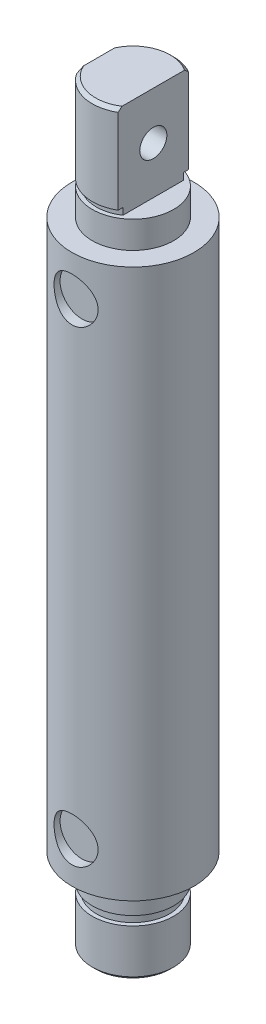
ISO-10303-21;
HEADER;
FILE_DESCRIPTION(('STEP AP214'),'2;1');
FILE_NAME('part.step','',(''),(''),'','','');
FILE_SCHEMA(('AUTOMOTIVE_DESIGN { 1 0 10303 214 1 1 1 1 }'));
ENDSEC;
DATA;
#1=APPLICATION_CONTEXT('core data for automotive mechanical design processes');
#2=APPLICATION_PROTOCOL_DEFINITION('international standard','automotive_design',2000,#1);
#3=PRODUCT_CONTEXT('',#1,'mechanical');
#4=PRODUCT('Part','Part','',(#3));
#5=PRODUCT_RELATED_PRODUCT_CATEGORY('part','',(#4));
#6=PRODUCT_DEFINITION_FORMATION('','',#4);
#7=PRODUCT_DEFINITION_CONTEXT('part definition',#1,'design');
#8=PRODUCT_DEFINITION('design','',#6,#7);
#9=PRODUCT_DEFINITION_SHAPE('','',#8);
#10=(LENGTH_UNIT() NAMED_UNIT(*) SI_UNIT(.MILLI.,.METRE.));
#11=(NAMED_UNIT(*) PLANE_ANGLE_UNIT() SI_UNIT($,.RADIAN.));
#12=(NAMED_UNIT(*) SI_UNIT($,.STERADIAN.) SOLID_ANGLE_UNIT());
#13=UNCERTAINTY_MEASURE_WITH_UNIT(LENGTH_MEASURE(1.E-05),#10,'distance_accuracy_value','');
#14=(GEOMETRIC_REPRESENTATION_CONTEXT(3) GLOBAL_UNCERTAINTY_ASSIGNED_CONTEXT((#13)) GLOBAL_UNIT_ASSIGNED_CONTEXT((#10,
#11,#12)) REPRESENTATION_CONTEXT('',''));
#15=CARTESIAN_POINT('',(0.,0.,0.));
#16=DIRECTION('',(0.,0.,1.));
#17=DIRECTION('',(1.,0.,0.));
#18=AXIS2_PLACEMENT_3D('',#15,#16,#17);
#19=CARTESIAN_POINT('',(0.,-6.35,0.));
#20=DIRECTION('',(0.,-1.,0.));
#21=DIRECTION('',(0.,0.,-1.));
#22=AXIS2_PLACEMENT_3D('',#19,#20,#21);
#23=PLANE('',#22);
#24=CARTESIAN_POINT('',(0.,-6.35,0.));
#25=DIRECTION('',(0.,-1.,0.));
#26=DIRECTION('',(0.,0.,-1.));
#27=AXIS2_PLACEMENT_3D('',#24,#25,#26);
#28=CIRCLE('',#27,9.525);
#29=CARTESIAN_POINT('',(0.,-6.35,9.525));
#30=VERTEX_POINT('',#29);
#31=EDGE_CURVE('E164',#30,#30,#28,.T.);
#32=ORIENTED_EDGE('',*,*,#31,.T.);
#33=EDGE_LOOP('',(#32));
#34=FACE_BOUND('',#33,.T.);
#35=CARTESIAN_POINT('',(0.,-6.35,0.));
#36=DIRECTION('',(0.,-1.,0.));
#37=DIRECTION('',(0.,0.,-1.));
#38=AXIS2_PLACEMENT_3D('',#35,#36,#37);
#39=CIRCLE('',#38,8.5598);
#40=CARTESIAN_POINT('',(0.,-6.35,-8.5598));
#41=VERTEX_POINT('',#40);
#42=EDGE_CURVE('E500',#41,#41,#39,.T.);
#43=ORIENTED_EDGE('',*,*,#42,.F.);
#44=EDGE_LOOP('',(#43));
#45=FACE_BOUND('',#44,.T.);
#46=ADVANCED_FACE('F35',(#34,#45),#23,.T.);
#47=CARTESIAN_POINT('',(0.,134.9375,0.));
#48=DIRECTION('',(0.,-1.,0.));
#49=DIRECTION('',(0.,0.,-1.));
#50=AXIS2_PLACEMENT_3D('',#47,#48,#49);
#51=CYLINDRICAL_SURFACE('',#50,9.525);
#52=DIRECTION('',(0.,-1.,0.));
#53=VECTOR('',#52,1.);
#54=CARTESIAN_POINT('',(4.7625,157.1625,8.24889197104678));
#55=LINE('',#54,#53);
#56=CARTESIAN_POINT('',(4.7625,156.3751,8.24889197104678));
#57=VERTEX_POINT('',#56);
#58=CARTESIAN_POINT('',(4.7625,136.525,8.24889197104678));
#59=VERTEX_POINT('',#58);
#60=EDGE_CURVE('E189',#57,#59,#55,.T.);
#61=ORIENTED_EDGE('',*,*,#60,.F.);
#62=CARTESIAN_POINT('',(0.,156.3751,0.));
#63=DIRECTION('',(0.,1.,0.));
#64=DIRECTION('',(0.,0.,1.));
#65=AXIS2_PLACEMENT_3D('',#62,#63,#64);
#66=CIRCLE('',#65,9.525);
#67=CARTESIAN_POINT('',(-7.9375,156.3751,5.2651418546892));
#68=VERTEX_POINT('',#67);
#69=EDGE_CURVE('E292',#57,#68,#66,.F.);
#70=ORIENTED_EDGE('',*,*,#69,.T.);
#71=DIRECTION('',(0.,-1.,0.));
#72=VECTOR('',#71,1.);
#73=CARTESIAN_POINT('',(-7.9375,157.1625,5.2651418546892));
#74=LINE('',#73,#72);
#75=CARTESIAN_POINT('',(-7.9375,136.525,5.26514185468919));
#76=VERTEX_POINT('',#75);
#77=EDGE_CURVE('E186',#68,#76,#74,.T.);
#78=ORIENTED_EDGE('',*,*,#77,.T.);
#79=CARTESIAN_POINT('',(0.,136.525,0.));
#80=DIRECTION('',(0.,-1.,0.));
#81=DIRECTION('',(0.,0.,-1.));
#82=AXIS2_PLACEMENT_3D('',#79,#80,#81);
#83=CIRCLE('',#82,9.525);
#84=EDGE_CURVE('E364',#59,#76,#83,.T.);
#85=ORIENTED_EDGE('',*,*,#84,.F.);
#86=EDGE_LOOP('',(#61,#70,#78,#85));
#87=FACE_BOUND('',#86,.T.);
#88=ADVANCED_FACE('F221',(#87),#51,.T.);
#89=DIRECTION('',(0.,-1.,0.));
#90=VECTOR('',#89,1.);
#91=CARTESIAN_POINT('',(-7.9375,157.1625,-5.2651418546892));
#92=LINE('',#91,#90);
#93=CARTESIAN_POINT('',(-7.9375,156.3751,-5.2651418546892));
#94=VERTEX_POINT('',#93);
#95=CARTESIAN_POINT('',(-7.9375,136.525,-5.26514185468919));
#96=VERTEX_POINT('',#95);
#97=EDGE_CURVE('E168',#94,#96,#92,.T.);
#98=ORIENTED_EDGE('',*,*,#97,.F.);
#99=CARTESIAN_POINT('',(0.,156.3751,0.));
#100=DIRECTION('',(0.,1.,0.));
#101=DIRECTION('',(0.,0.,1.));
#102=AXIS2_PLACEMENT_3D('',#99,#100,#101);
#103=CIRCLE('',#102,9.525);
#104=CARTESIAN_POINT('',(4.7625,156.3751,-8.24889197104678));
#105=VERTEX_POINT('',#104);
#106=EDGE_CURVE('E62',#94,#105,#103,.F.);
#107=ORIENTED_EDGE('',*,*,#106,.T.);
#108=DIRECTION('',(0.,-1.,0.));
#109=VECTOR('',#108,1.);
#110=CARTESIAN_POINT('',(4.7625,157.1625,-8.24889197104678));
#111=LINE('',#110,#109);
#112=CARTESIAN_POINT('',(4.7625,136.525,-8.24889197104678));
#113=VERTEX_POINT('',#112);
#114=EDGE_CURVE('E163',#105,#113,#111,.T.);
#115=ORIENTED_EDGE('',*,*,#114,.T.);
#116=EDGE_CURVE('E359',#96,#113,#83,.T.);
#117=ORIENTED_EDGE('',*,*,#116,.F.);
#118=EDGE_LOOP('',(#98,#107,#115,#117));
#119=FACE_BOUND('',#118,.T.);
#120=ADVANCED_FACE('F232',(#119),#51,.T.);
#121=CARTESIAN_POINT('',(0.,0.,0.));
#122=DIRECTION('',(0.,1.,0.));
#123=DIRECTION('',(0.,0.,1.));
#124=AXIS2_PLACEMENT_3D('',#121,#122,#123);
#125=PLANE('',#124);
#126=CARTESIAN_POINT('',(0.,0.,0.));
#127=DIRECTION('',(0.,1.,0.));
#128=DIRECTION('',(0.,0.,1.));
#129=AXIS2_PLACEMENT_3D('',#126,#127,#128);
#130=CIRCLE('',#129,14.2875);
#131=CARTESIAN_POINT('',(0.,0.,14.2875));
#132=VERTEX_POINT('',#131);
#133=EDGE_CURVE('E172',#132,#132,#130,.T.);
#134=ORIENTED_EDGE('',*,*,#133,.F.);
#135=EDGE_LOOP('',(#134));
#136=FACE_BOUND('',#135,.T.);
#137=CARTESIAN_POINT('',(0.,0.,0.));
#138=DIRECTION('',(0.,1.,0.));
#139=DIRECTION('',(0.,0.,1.));
#140=AXIS2_PLACEMENT_3D('',#137,#138,#139);
#141=CIRCLE('',#140,9.525);
#142=CARTESIAN_POINT('',(0.,0.,9.525));
#143=VERTEX_POINT('',#142);
#144=EDGE_CURVE('E138',#143,#143,#141,.F.);
#145=ORIENTED_EDGE('',*,*,#144,.F.);
#146=EDGE_LOOP('',(#145));
#147=FACE_BOUND('',#146,.T.);
#148=ADVANCED_FACE('F233',(#136,#147),#125,.F.);
#149=CARTESIAN_POINT('',(0.,128.5875,0.));
#150=DIRECTION('',(0.,1.,0.));
#151=DIRECTION('',(0.,0.,1.));
#152=AXIS2_PLACEMENT_3D('',#149,#150,#151);
#153=PLANE('',#152);
#154=CARTESIAN_POINT('',(0.,128.5875,0.));
#155=DIRECTION('',(0.,1.,0.));
#156=DIRECTION('',(0.,0.,1.));
#157=AXIS2_PLACEMENT_3D('',#154,#155,#156);
#158=CIRCLE('',#157,14.2875);
#159=CARTESIAN_POINT('',(0.,128.5875,14.2875));
#160=VERTEX_POINT('',#159);
#161=EDGE_CURVE('E175',#160,#160,#158,.T.);
#162=ORIENTED_EDGE('',*,*,#161,.T.);
#163=EDGE_LOOP('',(#162));
#164=FACE_BOUND('',#163,.T.);
#165=CARTESIAN_POINT('',(0.,128.5875,0.));
#166=DIRECTION('',(0.,1.,0.));
#167=DIRECTION('',(0.,0.,1.));
#168=AXIS2_PLACEMENT_3D('',#165,#166,#167);
#169=CIRCLE('',#168,9.525);
#170=CARTESIAN_POINT('',(0.,128.5875,-9.525));
#171=VERTEX_POINT('',#170);
#172=EDGE_CURVE('E167',#171,#171,#169,.T.);
#173=ORIENTED_EDGE('',*,*,#172,.F.);
#174=EDGE_LOOP('',(#173));
#175=FACE_BOUND('',#174,.T.);
#176=ADVANCED_FACE('F235',(#164,#175),#153,.T.);
#177=CARTESIAN_POINT('',(0.,128.5875,0.));
#178=DIRECTION('',(0.,-1.,0.));
#179=DIRECTION('',(0.,0.,-1.));
#180=AXIS2_PLACEMENT_3D('',#177,#178,#179);
#181=CYLINDRICAL_SURFACE('',#180,14.2875);
#182=CARTESIAN_POINT('',(5.15874000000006,119.0625,13.3236653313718));
#183=CARTESIAN_POINT('',(5.1587404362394,118.922816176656,13.3236649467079));
#184=CARTESIAN_POINT('',(5.15306200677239,118.783138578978,13.325867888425));
#185=CARTESIAN_POINT('',(5.13040559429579,118.504790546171,13.3346069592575));
#186=CARTESIAN_POINT('',(5.11342378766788,118.366120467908,13.3411445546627));
#187=CARTESIAN_POINT('',(5.06833902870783,118.090916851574,13.3583372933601));
#188=CARTESIAN_POINT('',(5.04024024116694,117.954382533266,13.3689908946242));
#189=CARTESIAN_POINT('',(4.97318449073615,117.684311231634,13.3940797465));
#190=CARTESIAN_POINT('',(4.93422324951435,117.550775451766,13.4085164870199));
#191=CARTESIAN_POINT('',(4.84591339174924,117.28799251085,13.4406837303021));
#192=CARTESIAN_POINT('',(4.79659286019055,117.158734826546,13.4584053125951));
#193=CARTESIAN_POINT('',(4.68791492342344,116.904922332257,13.4966449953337));
#194=CARTESIAN_POINT('',(4.62855378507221,116.780369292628,13.5171641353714));
#195=CARTESIAN_POINT('',(4.43606227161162,116.414931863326,13.582060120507));
#196=CARTESIAN_POINT('',(4.28845629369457,116.182069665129,13.6298013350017));
#197=CARTESIAN_POINT('',(3.95183781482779,115.734219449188,13.7312700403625));
#198=CARTESIAN_POINT('',(3.76135188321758,115.52038613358,13.7851643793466));
#199=CARTESIAN_POINT('',(3.34727158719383,115.126788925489,13.8915062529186));
#200=CARTESIAN_POINT('',(3.12367081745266,114.947031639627,13.9439535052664));
#201=CARTESIAN_POINT('',(2.76398265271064,114.704186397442,14.018158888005));
#202=CARTESIAN_POINT('',(2.63789299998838,114.626728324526,14.0424884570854));
#203=CARTESIAN_POINT('',(2.37918623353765,114.482767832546,14.08862494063));
#204=CARTESIAN_POINT('',(2.24657175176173,114.416261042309,14.1104328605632));
#205=CARTESIAN_POINT('',(1.97568405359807,114.294762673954,14.1509043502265));
#206=CARTESIAN_POINT('',(1.83740986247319,114.239773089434,14.1695673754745));
#207=CARTESIAN_POINT('',(1.55628028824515,114.14185682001,14.20319231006));
#208=CARTESIAN_POINT('',(1.41342706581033,114.098924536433,14.2181559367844));
#209=CARTESIAN_POINT('',(1.12995721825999,114.026994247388,14.2434296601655));
#210=CARTESIAN_POINT('',(0.989478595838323,113.997508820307,14.2539015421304));
#211=CARTESIAN_POINT('',(0.706367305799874,113.950335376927,14.2707322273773));
#212=CARTESIAN_POINT('',(0.563735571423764,113.932642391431,14.2770927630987));
#213=CARTESIAN_POINT('',(0.277375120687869,113.909219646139,14.2855254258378));
#214=CARTESIAN_POINT('',(0.133646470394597,113.903489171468,14.2875978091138));
#215=CARTESIAN_POINT('',(-0.153782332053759,113.904050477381,14.2873950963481));
#216=CARTESIAN_POINT('',(-0.297482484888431,113.910341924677,14.2851201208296));
#217=CARTESIAN_POINT('',(-0.577109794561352,113.934311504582,14.2764932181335));
#218=CARTESIAN_POINT('',(-0.713089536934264,113.951450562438,14.2703343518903));
#219=CARTESIAN_POINT('',(-0.983085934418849,113.99644855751,14.2542798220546));
#220=CARTESIAN_POINT('',(-1.11710191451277,114.02431109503,14.2443829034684));
#221=CARTESIAN_POINT('',(-1.38216767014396,114.090491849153,14.2211098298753));
#222=CARTESIAN_POINT('',(-1.5132184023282,114.128806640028,14.2077348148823));
#223=CARTESIAN_POINT('',(-1.77159674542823,114.215580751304,14.1778357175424));
#224=CARTESIAN_POINT('',(-1.89892292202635,114.264043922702,14.1613104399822));
#225=CARTESIAN_POINT('',(-2.15074720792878,114.371458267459,14.1252729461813));
#226=CARTESIAN_POINT('',(-2.27518237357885,114.430544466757,14.1057227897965));
#227=CARTESIAN_POINT('',(-2.51865071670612,114.558287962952,14.0642929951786));
#228=CARTESIAN_POINT('',(-2.63768191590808,114.626948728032,14.0424125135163));
#229=CARTESIAN_POINT('',(-2.98559887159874,114.846590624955,13.9740670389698));
#230=CARTESIAN_POINT('',(-3.20548456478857,115.011307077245,13.924871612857));
#231=CARTESIAN_POINT('',(-3.62719998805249,115.382906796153,13.8212127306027));
#232=CARTESIAN_POINT('',(-3.8273878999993,115.591601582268,13.7666083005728));
#233=CARTESIAN_POINT('',(-4.19060911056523,116.040162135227,13.6604285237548));
#234=CARTESIAN_POINT('',(-4.35363442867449,116.280034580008,13.6088538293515));
#235=CARTESIAN_POINT('',(-4.5680614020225,116.660980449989,13.5377728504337));
#236=CARTESIAN_POINT('',(-4.63502720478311,116.792902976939,13.5149319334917));
#237=CARTESIAN_POINT('',(-4.75752951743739,117.062404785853,13.4722965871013));
#238=CARTESIAN_POINT('',(-4.81307090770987,117.199981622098,13.4525008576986));
#239=CARTESIAN_POINT('',(-4.91221250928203,117.479839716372,13.4166168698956));
#240=CARTESIAN_POINT('',(-4.95581254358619,117.622121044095,13.400528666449));
#241=CARTESIAN_POINT('',(-5.03061288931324,117.91025468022,13.3726282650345));
#242=CARTESIAN_POINT('',(-5.06181913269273,118.056105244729,13.3608140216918));
#243=CARTESIAN_POINT('',(-5.11023362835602,118.342686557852,13.3423687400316));
#244=CARTESIAN_POINT('',(-5.12807938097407,118.483294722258,13.3355023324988));
#245=CARTESIAN_POINT('',(-5.15213568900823,118.765593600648,13.3262268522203));
#246=CARTESIAN_POINT('',(-5.15835115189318,118.907283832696,13.3238158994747));
#247=CARTESIAN_POINT('',(-5.15909347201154,119.190697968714,13.3235284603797));
#248=CARTESIAN_POINT('',(-5.15362037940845,119.332421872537,13.32565195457));
#249=CARTESIAN_POINT('',(-5.1310451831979,119.614799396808,13.3343607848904));
#250=CARTESIAN_POINT('',(-5.11394328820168,119.75545303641,13.3409460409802));
#251=CARTESIAN_POINT('',(-5.06927476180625,120.028613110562,13.3579808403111));
#252=CARTESIAN_POINT('',(-5.04218964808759,120.161209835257,13.3682520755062));
#253=CARTESIAN_POINT('',(-4.9777761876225,120.42360280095,13.3923702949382));
#254=CARTESIAN_POINT('',(-4.94044436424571,120.553398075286,13.4062184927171));
#255=CARTESIAN_POINT('',(-4.85586580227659,120.809301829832,13.4370848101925));
#256=CARTESIAN_POINT('',(-4.80862112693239,120.935411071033,13.4541022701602));
#257=CARTESIAN_POINT('',(-4.70458767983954,121.183240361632,13.4908320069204));
#258=CARTESIAN_POINT('',(-4.64779544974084,121.304958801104,13.5105452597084));
#259=CARTESIAN_POINT('',(-4.45936465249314,121.670865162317,13.5744157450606));
#260=CARTESIAN_POINT('',(-4.31262548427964,121.906847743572,13.6221721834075));
#261=CARTESIAN_POINT('',(-3.98374232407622,122.351721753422,13.7219479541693));
#262=CARTESIAN_POINT('',(-3.80158621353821,122.560603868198,13.7739687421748));
#263=CARTESIAN_POINT('',(-3.49938993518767,122.855689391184,13.8527489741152));
#264=CARTESIAN_POINT('',(-3.39044242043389,122.953376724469,13.8798792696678));
#265=CARTESIAN_POINT('',(-3.16451034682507,123.139244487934,13.9331252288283));
#266=CARTESIAN_POINT('',(-3.04752861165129,123.227428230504,13.9592412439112));
#267=CARTESIAN_POINT('',(-2.80618662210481,123.393712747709,14.0097530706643));
#268=CARTESIAN_POINT('',(-2.68182331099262,123.471809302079,14.0341481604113));
#269=CARTESIAN_POINT('',(-2.42659742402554,123.617254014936,14.0805217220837));
#270=CARTESIAN_POINT('',(-2.29573764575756,123.684606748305,14.1025012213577));
#271=CARTESIAN_POINT('',(-2.02892380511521,123.807767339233,14.1433467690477));
#272=CARTESIAN_POINT('',(-1.89299428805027,123.863623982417,14.1622259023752));
#273=CARTESIAN_POINT('',(-1.61652029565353,123.963628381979,14.1964400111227));
#274=CARTESIAN_POINT('',(-1.47597775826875,124.007780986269,14.2117764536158));
#275=CARTESIAN_POINT('',(-1.19129383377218,124.083966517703,14.2384658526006));
#276=CARTESIAN_POINT('',(-1.04715298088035,124.116001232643,14.2498193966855));
#277=CARTESIAN_POINT('',(-0.756389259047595,124.167622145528,14.2682075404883));
#278=CARTESIAN_POINT('',(-0.609766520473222,124.187208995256,14.2752423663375));
#279=CARTESIAN_POINT('',(-0.323292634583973,124.212997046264,14.2845211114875));
#280=CARTESIAN_POINT('',(-0.183509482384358,124.21987146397,14.2870059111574));
#281=CARTESIAN_POINT('',(0.0962156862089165,124.22223924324,14.2878607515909));
#282=CARTESIAN_POINT('',(0.236157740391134,124.217728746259,14.2862293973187));
#283=CARTESIAN_POINT('',(0.515037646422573,124.197368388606,14.2788949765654));
#284=CARTESIAN_POINT('',(0.653975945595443,124.181523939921,14.2731938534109));
#285=CARTESIAN_POINT('',(0.929948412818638,124.138650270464,14.2578735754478));
#286=CARTESIAN_POINT('',(1.06698185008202,124.111616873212,14.2482529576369));
#287=CARTESIAN_POINT('',(1.33517070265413,124.047328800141,14.2255999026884));
#288=CARTESIAN_POINT('',(1.46638914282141,124.010308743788,14.2126460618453));
#289=CARTESIAN_POINT('',(1.72521181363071,123.926117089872,14.1835562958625));
#290=CARTESIAN_POINT('',(1.85281474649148,123.878941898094,14.1674192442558));
#291=CARTESIAN_POINT('',(2.10355156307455,123.774833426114,14.1323650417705));
#292=CARTESIAN_POINT('',(2.2266864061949,123.717902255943,14.1134484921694));
#293=CARTESIAN_POINT('',(2.46781449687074,123.594701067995,14.0732910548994));
#294=CARTESIAN_POINT('',(2.58580587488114,123.528427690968,14.0520493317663));
#295=CARTESIAN_POINT('',(2.94027955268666,123.310580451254,13.9837997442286));
#296=CARTESIAN_POINT('',(3.1672436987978,123.144125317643,13.9337206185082));
#297=CARTESIAN_POINT('',(3.59082807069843,122.77695443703,13.8306286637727));
#298=CARTESIAN_POINT('',(3.78743777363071,122.576226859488,13.7776148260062));
#299=CARTESIAN_POINT('',(4.06043916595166,122.247943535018,13.6987252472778));
#300=CARTESIAN_POINT('',(4.14954564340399,122.130970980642,13.6719301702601));
#301=CARTESIAN_POINT('',(4.31757490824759,121.889642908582,13.6197992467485));
#302=CARTESIAN_POINT('',(4.39650142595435,121.76529011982,13.5944628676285));
#303=CARTESIAN_POINT('',(4.54362264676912,121.509911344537,13.5460015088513));
#304=CARTESIAN_POINT('',(4.61181277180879,121.378882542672,13.5228774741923));
#305=CARTESIAN_POINT('',(4.73683717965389,121.111107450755,13.4795922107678));
#306=CARTESIAN_POINT('',(4.79367641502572,120.974363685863,13.4594296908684));
#307=CARTESIAN_POINT('',(4.89618512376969,120.694219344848,13.4224826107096));
#308=CARTESIAN_POINT('',(4.94169727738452,120.550754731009,13.4057461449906));
#309=CARTESIAN_POINT('',(5.02007364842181,120.260043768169,13.3765940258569));
#310=CARTESIAN_POINT('',(5.05294337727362,120.112799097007,13.3641764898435));
#311=CARTESIAN_POINT('',(5.10568586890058,119.81571009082,13.3441157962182));
#312=CARTESIAN_POINT('',(5.12556157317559,119.665866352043,13.3364715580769));
#313=CARTESIAN_POINT('',(5.15208790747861,119.364845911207,13.3262467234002));
#314=CARTESIAN_POINT('',(5.15873952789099,119.213669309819,13.3236657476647));
#315=CARTESIAN_POINT('',(5.15874000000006,119.0625,13.3236653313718));
#316=B_SPLINE_CURVE_WITH_KNOTS('',3,(#182,#183,#184,#185,#186,#187,#188,#189,#190,#191,#192,
#193,#194,#195,#196,#197,#198,#199,#200,#201,#202,#203,#204,#205,#206,#207,#208,#209,#210,#211,
#212,#213,#214,#215,#216,#217,#218,#219,#220,#221,#222,#223,#224,#225,#226,#227,#228,#229,#230,
#231,#232,#233,#234,#235,#236,#237,#238,#239,#240,#241,#242,#243,#244,#245,#246,#247,#248,#249,
#250,#251,#252,#253,#254,#255,#256,#257,#258,#259,#260,#261,#262,#263,#264,#265,#266,#267,#268,
#269,#270,#271,#272,#273,#274,#275,#276,#277,#278,#279,#280,#281,#282,#283,#284,#285,#286,#287,
#288,#289,#290,#291,#292,#293,#294,#295,#296,#297,#298,#299,#300,#301,#302,#303,#304,#305,#306,
#307,#308,#309,#310,#311,#312,#313,#314,#315),.UNSPECIFIED.,.T.,.F.,(4,2,2,2,2,2,2,2,2,2,2,2,2,
2,2,2,2,2,2,2,2,2,2,2,2,2,2,2,2,2,2,2,2,2,2,2,2,2,2,2,2,2,2,2,2,2,2,2,2,2,2,2,2,2,2,2,2,2,2,2,2,
2,2,2,2,2,4),(0.,0.41890873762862,0.837959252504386,1.25685292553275,1.67591181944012,
2.0938489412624,2.51194179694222,3.34749842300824,4.21799687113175,5.08866391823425,
5.53810109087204,5.98735843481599,6.43669347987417,6.88581953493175,7.31703432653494,
7.7480672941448,8.17907450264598,8.61006976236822,9.02116812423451,9.43240462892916,
9.84350651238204,10.2547646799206,10.6716766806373,11.0887400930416,11.9222917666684,
12.8013642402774,13.6806253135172,14.1292482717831,14.5776791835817,15.0261167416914,
15.4743394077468,15.8995047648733,16.3244906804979,16.7494747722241,17.1744512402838,
17.5811568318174,17.9880005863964,18.3947597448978,18.8016665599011,19.6436457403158,
20.4859135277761,20.9319385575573,21.3778076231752,21.8238626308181,22.2697271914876,
22.7136587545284,23.1574061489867,23.6010880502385,24.0447467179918,24.4641519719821,
24.8836993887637,25.3030466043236,25.7225504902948,26.1329479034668,26.5434908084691,
26.9539450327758,27.3645472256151,28.2181875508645,29.0721231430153,29.5200715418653,
29.9678553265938,30.4158295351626,30.8636078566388,31.3172959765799,31.7707860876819,
32.2241735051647,32.6775269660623),.UNSPECIFIED.);
#317=CARTESIAN_POINT('',(5.15874000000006,119.0625,13.3236653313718));
#318=VERTEX_POINT('',#317);
#319=EDGE_CURVE('E11',#318,#318,#316,.T.);
#320=ORIENTED_EDGE('',*,*,#319,.T.);
#321=EDGE_LOOP('',(#320));
#322=FACE_BOUND('',#321,.T.);
#323=CARTESIAN_POINT('',(5.15874,9.525,13.3236653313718));
#324=CARTESIAN_POINT('',(5.15874043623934,9.38531617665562,13.3236649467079));
#325=CARTESIAN_POINT('',(5.15306200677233,9.24563857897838,13.325867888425));
#326=CARTESIAN_POINT('',(5.13040559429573,8.96729054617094,13.3346069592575));
#327=CARTESIAN_POINT('',(5.11342378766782,8.82862046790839,13.3411445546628));
#328=CARTESIAN_POINT('',(5.06833902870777,8.55341685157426,13.3583372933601));
#329=CARTESIAN_POINT('',(5.04024024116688,8.41688253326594,13.3689908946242));
#330=CARTESIAN_POINT('',(4.9731844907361,8.14681123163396,13.3940797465));
#331=CARTESIAN_POINT('',(4.93422324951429,8.01327545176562,13.4085164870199));
#332=CARTESIAN_POINT('',(4.84591339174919,7.75049251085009,13.4406837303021));
#333=CARTESIAN_POINT('',(4.7965928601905,7.62123482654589,13.4584053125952));
#334=CARTESIAN_POINT('',(4.68791492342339,7.36742233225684,13.4966449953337));
#335=CARTESIAN_POINT('',(4.62855378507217,7.24286929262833,13.5171641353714));
#336=CARTESIAN_POINT('',(4.43606227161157,6.87743186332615,13.582060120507));
#337=CARTESIAN_POINT('',(4.28845629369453,6.64456966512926,13.6298013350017));
#338=CARTESIAN_POINT('',(3.95183781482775,6.19671944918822,13.7312700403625));
#339=CARTESIAN_POINT('',(3.76135188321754,5.98288613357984,13.7851643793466));
#340=CARTESIAN_POINT('',(3.34727158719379,5.58928892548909,13.8915062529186));
#341=CARTESIAN_POINT('',(3.12367081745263,5.40953163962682,13.9439535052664));
#342=CARTESIAN_POINT('',(2.7639826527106,5.16668639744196,14.018158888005));
#343=CARTESIAN_POINT('',(2.63789299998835,5.08922832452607,14.0424884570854));
#344=CARTESIAN_POINT('',(2.37918623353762,4.9452678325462,14.08862494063));
#345=CARTESIAN_POINT('',(2.24657175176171,4.87876104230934,14.1104328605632));
#346=CARTESIAN_POINT('',(1.97568405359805,4.75726267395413,14.1509043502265));
#347=CARTESIAN_POINT('',(1.83740986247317,4.70227308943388,14.1695673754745));
#348=CARTESIAN_POINT('',(1.55628028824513,4.60435682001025,14.20319231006));
#349=CARTESIAN_POINT('',(1.41342706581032,4.56142453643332,14.2181559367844));
#350=CARTESIAN_POINT('',(1.12995721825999,4.48949424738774,14.2434296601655));
#351=CARTESIAN_POINT('',(0.989478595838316,4.46000882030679,14.2539015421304));
#352=CARTESIAN_POINT('',(0.70636730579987,4.41283537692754,14.2707322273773));
#353=CARTESIAN_POINT('',(0.563735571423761,4.395142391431,14.2770927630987));
#354=CARTESIAN_POINT('',(0.277375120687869,4.37171964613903,14.2855254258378));
#355=CARTESIAN_POINT('',(0.133646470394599,4.36598917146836,14.2875978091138));
#356=CARTESIAN_POINT('',(-0.153782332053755,4.36655047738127,14.2873950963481));
#357=CARTESIAN_POINT('',(-0.297482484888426,4.37284192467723,14.2851201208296));
#358=CARTESIAN_POINT('',(-0.577109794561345,4.39681150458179,14.2764932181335));
#359=CARTESIAN_POINT('',(-0.713089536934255,4.41395056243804,14.2703343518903));
#360=CARTESIAN_POINT('',(-0.983085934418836,4.45894855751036,14.2542798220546));
#361=CARTESIAN_POINT('',(-1.11710191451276,4.48681109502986,14.2443829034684));
#362=CARTESIAN_POINT('',(-1.38216767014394,4.5529918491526,14.2211098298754));
#363=CARTESIAN_POINT('',(-1.51321840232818,4.59130664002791,14.2077348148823));
#364=CARTESIAN_POINT('',(-1.77159674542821,4.67808075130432,14.1778357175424));
#365=CARTESIAN_POINT('',(-1.89892292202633,4.72654392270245,14.1613104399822));
#366=CARTESIAN_POINT('',(-2.15074720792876,4.83395826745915,14.1252729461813));
#367=CARTESIAN_POINT('',(-2.27518237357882,4.89304446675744,14.1057227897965));
#368=CARTESIAN_POINT('',(-2.51865071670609,5.02078796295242,14.0642929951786));
#369=CARTESIAN_POINT('',(-2.63768191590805,5.08944872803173,14.0424125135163));
#370=CARTESIAN_POINT('',(-2.9855988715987,5.30909062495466,13.9740670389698));
#371=CARTESIAN_POINT('',(-3.20548456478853,5.47380707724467,13.924871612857));
#372=CARTESIAN_POINT('',(-3.62719998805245,5.8454067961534,13.8212127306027));
#373=CARTESIAN_POINT('',(-3.82738789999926,6.05410158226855,13.7666083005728));
#374=CARTESIAN_POINT('',(-4.19060911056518,6.50266213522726,13.6604285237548));
#375=CARTESIAN_POINT('',(-4.35363442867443,6.74253458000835,13.6088538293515));
#376=CARTESIAN_POINT('',(-4.56806140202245,7.12348044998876,13.5377728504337));
#377=CARTESIAN_POINT('',(-4.63502720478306,7.25540297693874,13.5149319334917));
#378=CARTESIAN_POINT('',(-4.75752951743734,7.52490478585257,13.4722965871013));
#379=CARTESIAN_POINT('',(-4.81307090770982,7.66248162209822,13.4525008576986));
#380=CARTESIAN_POINT('',(-4.91221250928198,7.94233971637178,13.4166168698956));
#381=CARTESIAN_POINT('',(-4.95581254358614,8.08462104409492,13.400528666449));
#382=CARTESIAN_POINT('',(-5.03061288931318,8.37275468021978,13.3726282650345));
#383=CARTESIAN_POINT('',(-5.06181913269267,8.5186052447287,13.3608140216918));
#384=CARTESIAN_POINT('',(-5.11023362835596,8.80518655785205,13.3423687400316));
#385=CARTESIAN_POINT('',(-5.12807938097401,8.94579472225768,13.3355023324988));
#386=CARTESIAN_POINT('',(-5.15213568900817,9.22809360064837,13.3262268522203));
#387=CARTESIAN_POINT('',(-5.15835115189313,9.36978383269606,13.3238158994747));
#388=CARTESIAN_POINT('',(-5.15909347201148,9.65319796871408,13.3235284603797));
#389=CARTESIAN_POINT('',(-5.15362037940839,9.79492187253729,13.32565195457));
#390=CARTESIAN_POINT('',(-5.13104518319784,10.0772993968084,13.3343607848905));
#391=CARTESIAN_POINT('',(-5.11394328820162,10.2179530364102,13.3409460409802));
#392=CARTESIAN_POINT('',(-5.06927476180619,10.4911131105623,13.3579808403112));
#393=CARTESIAN_POINT('',(-5.04218964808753,10.6237098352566,13.3682520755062));
#394=CARTESIAN_POINT('',(-4.97777618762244,10.8861028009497,13.3923702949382));
#395=CARTESIAN_POINT('',(-4.94044436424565,11.0158980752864,13.4062184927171));
#396=CARTESIAN_POINT('',(-4.85586580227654,11.2718018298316,13.4370848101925));
#397=CARTESIAN_POINT('',(-4.80862112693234,11.397911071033,13.4541022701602));
#398=CARTESIAN_POINT('',(-4.70458767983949,11.6457403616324,13.4908320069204));
#399=CARTESIAN_POINT('',(-4.64779544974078,11.7674588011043,13.5105452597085));
#400=CARTESIAN_POINT('',(-4.45936465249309,12.133365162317,13.5744157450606));
#401=CARTESIAN_POINT('',(-4.31262548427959,12.3693477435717,13.6221721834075));
#402=CARTESIAN_POINT('',(-3.98374232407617,12.8142217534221,13.7219479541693));
#403=CARTESIAN_POINT('',(-3.80158621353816,13.023103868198,13.7739687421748));
#404=CARTESIAN_POINT('',(-3.49938993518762,13.3181893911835,13.8527489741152));
#405=CARTESIAN_POINT('',(-3.39044242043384,13.4158767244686,13.8798792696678));
#406=CARTESIAN_POINT('',(-3.16451034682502,13.6017444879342,13.9331252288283));
#407=CARTESIAN_POINT('',(-3.04752861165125,13.6899282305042,13.9592412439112));
#408=CARTESIAN_POINT('',(-2.80618662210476,13.8562127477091,14.0097530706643));
#409=CARTESIAN_POINT('',(-2.68182331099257,13.9343093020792,14.0341481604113));
#410=CARTESIAN_POINT('',(-2.42659742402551,14.079754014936,14.0805217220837));
#411=CARTESIAN_POINT('',(-2.29573764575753,14.1471067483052,14.1025012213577));
#412=CARTESIAN_POINT('',(-2.02892380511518,14.2702673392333,14.1433467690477));
#413=CARTESIAN_POINT('',(-1.89299428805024,14.3261239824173,14.1622259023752));
#414=CARTESIAN_POINT('',(-1.6165202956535,14.4261283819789,14.1964400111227));
#415=CARTESIAN_POINT('',(-1.47597775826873,14.4702809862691,14.2117764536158));
#416=CARTESIAN_POINT('',(-1.19129383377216,14.546466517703,14.2384658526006));
#417=CARTESIAN_POINT('',(-1.04715298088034,14.5785012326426,14.2498193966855));
#418=CARTESIAN_POINT('',(-0.756389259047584,14.6301221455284,14.2682075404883));
#419=CARTESIAN_POINT('',(-0.609766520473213,14.6497089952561,14.2752423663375));
#420=CARTESIAN_POINT('',(-0.323292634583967,14.6754970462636,14.2845211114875));
#421=CARTESIAN_POINT('',(-0.183509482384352,14.6823714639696,14.2870059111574));
#422=CARTESIAN_POINT('',(0.0962156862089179,14.6847392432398,14.2878607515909));
#423=CARTESIAN_POINT('',(0.236157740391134,14.6802287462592,14.2862293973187));
#424=CARTESIAN_POINT('',(0.51503764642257,14.659868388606,14.2788949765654));
#425=CARTESIAN_POINT('',(0.653975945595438,14.6440239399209,14.2731938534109));
#426=CARTESIAN_POINT('',(0.92994841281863,14.6011502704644,14.2578735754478));
#427=CARTESIAN_POINT('',(1.06698185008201,14.5741168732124,14.2482529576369));
#428=CARTESIAN_POINT('',(1.33517070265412,14.5098288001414,14.2255999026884));
#429=CARTESIAN_POINT('',(1.4663891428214,14.4728087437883,14.2126460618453));
#430=CARTESIAN_POINT('',(1.72521181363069,14.3886170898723,14.1835562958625));
#431=CARTESIAN_POINT('',(1.85281474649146,14.3414418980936,14.1674192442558));
#432=CARTESIAN_POINT('',(2.10355156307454,14.2373334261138,14.1323650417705));
#433=CARTESIAN_POINT('',(2.22668640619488,14.1804022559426,14.1134484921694));
#434=CARTESIAN_POINT('',(2.46781449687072,14.0572010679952,14.0732910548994));
#435=CARTESIAN_POINT('',(2.58580587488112,13.9909276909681,14.0520493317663));
#436=CARTESIAN_POINT('',(2.94027955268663,13.7730804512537,13.9837997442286));
#437=CARTESIAN_POINT('',(3.16724369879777,13.6066253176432,13.9337206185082));
#438=CARTESIAN_POINT('',(3.5908280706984,13.2394544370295,13.8306286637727));
#439=CARTESIAN_POINT('',(3.78743777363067,13.0387268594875,13.7776148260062));
#440=CARTESIAN_POINT('',(4.06043916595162,12.7104435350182,13.6987252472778));
#441=CARTESIAN_POINT('',(4.14954564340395,12.5934709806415,13.6719301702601));
#442=CARTESIAN_POINT('',(4.31757490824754,12.3521429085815,13.6197992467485));
#443=CARTESIAN_POINT('',(4.3965014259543,12.2277901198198,13.5944628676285));
#444=CARTESIAN_POINT('',(4.54362264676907,11.9724113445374,13.5460015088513));
#445=CARTESIAN_POINT('',(4.61181277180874,11.8413825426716,13.5228774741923));
#446=CARTESIAN_POINT('',(4.73683717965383,11.5736074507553,13.4795922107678));
#447=CARTESIAN_POINT('',(4.79367641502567,11.4368636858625,13.4594296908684));
#448=CARTESIAN_POINT('',(4.89618512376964,11.1567193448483,13.4224826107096));
#449=CARTESIAN_POINT('',(4.94169727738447,11.0132547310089,13.4057461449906));
#450=CARTESIAN_POINT('',(5.02007364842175,10.7225437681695,13.3765940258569));
#451=CARTESIAN_POINT('',(5.05294337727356,10.5752990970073,13.3641764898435));
#452=CARTESIAN_POINT('',(5.10568586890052,10.2782100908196,13.3441157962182));
#453=CARTESIAN_POINT('',(5.12556157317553,10.1283663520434,13.3364715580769));
#454=CARTESIAN_POINT('',(5.15208790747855,9.8273459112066,13.3262467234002));
#455=CARTESIAN_POINT('',(5.15873952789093,9.67616930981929,13.3236657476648));
#456=CARTESIAN_POINT('',(5.15874,9.525,13.3236653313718));
#457=B_SPLINE_CURVE_WITH_KNOTS('',3,(#323,#324,#325,#326,#327,#328,#329,#330,#331,#332,#333,
#334,#335,#336,#337,#338,#339,#340,#341,#342,#343,#344,#345,#346,#347,#348,#349,#350,#351,#352,
#353,#354,#355,#356,#357,#358,#359,#360,#361,#362,#363,#364,#365,#366,#367,#368,#369,#370,#371,
#372,#373,#374,#375,#376,#377,#378,#379,#380,#381,#382,#383,#384,#385,#386,#387,#388,#389,#390,
#391,#392,#393,#394,#395,#396,#397,#398,#399,#400,#401,#402,#403,#404,#405,#406,#407,#408,#409,
#410,#411,#412,#413,#414,#415,#416,#417,#418,#419,#420,#421,#422,#423,#424,#425,#426,#427,#428,
#429,#430,#431,#432,#433,#434,#435,#436,#437,#438,#439,#440,#441,#442,#443,#444,#445,#446,#447,
#448,#449,#450,#451,#452,#453,#454,#455,#456),.UNSPECIFIED.,.T.,.F.,(4,2,2,2,2,2,2,2,2,2,2,2,2,
2,2,2,2,2,2,2,2,2,2,2,2,2,2,2,2,2,2,2,2,2,2,2,2,2,2,2,2,2,2,2,2,2,2,2,2,2,2,2,2,2,2,2,2,2,2,2,2,
2,2,2,2,2,4),(0.,0.418908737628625,0.837959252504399,1.25685292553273,1.6759118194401,
2.09384894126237,2.51194179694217,3.3474984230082,4.2179968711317,5.08866391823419,
5.53810109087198,5.98735843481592,6.43669347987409,6.88581953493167,7.31703432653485,
7.7480672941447,8.17907450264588,8.61006976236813,9.0211681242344,9.43240462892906,
9.84350651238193,10.2547646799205,10.6716766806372,11.0887400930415,11.9222917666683,
12.8013642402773,13.680625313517,14.129248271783,14.5776791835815,15.0261167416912,
15.4743394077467,15.8995047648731,16.3244906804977,16.7494747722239,17.1744512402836,
17.5811568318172,17.9880005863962,18.3947597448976,18.8016665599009,19.6436457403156,
20.4859135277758,20.9319385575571,21.377807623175,21.8238626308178,22.2697271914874,
22.7136587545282,23.1574061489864,23.6010880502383,24.0447467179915,24.4641519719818,
24.8836993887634,25.3030466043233,25.7225504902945,26.1329479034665,26.5434908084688,
26.9539450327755,27.3645472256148,28.2181875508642,29.072123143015,29.5200715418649,
29.9678553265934,30.4158295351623,30.8636078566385,31.3172959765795,31.7707860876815,
32.2241735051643,32.6775269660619),.UNSPECIFIED.);
#458=CARTESIAN_POINT('',(5.15874,9.525,13.3236653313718));
#459=VERTEX_POINT('',#458);
#460=EDGE_CURVE('E47',#459,#459,#457,.T.);
#461=ORIENTED_EDGE('',*,*,#460,.T.);
#462=EDGE_LOOP('',(#461));
#463=FACE_BOUND('',#462,.T.);
#464=ORIENTED_EDGE('',*,*,#161,.F.);
#465=EDGE_LOOP('',(#464));
#466=FACE_BOUND('',#465,.T.);
#467=ORIENTED_EDGE('',*,*,#133,.T.);
#468=EDGE_LOOP('',(#467));
#469=FACE_BOUND('',#468,.T.);
#470=ADVANCED_FACE('F37',(#322,#463,#466,#469),#181,.T.);
#471=CARTESIAN_POINT('',(0.,134.9375,0.));
#472=DIRECTION('',(0.,1.,0.));
#473=DIRECTION('',(0.,0.,1.));
#474=AXIS2_PLACEMENT_3D('',#471,#472,#473);
#475=CIRCLE('',#474,9.525);
#476=CARTESIAN_POINT('',(0.,134.9375,-9.525));
#477=VERTEX_POINT('',#476);
#478=EDGE_CURVE('E171',#477,#477,#475,.T.);
#479=CARTESIAN_POINT('',(0.,134.9375,-9.525));
#480=CARTESIAN_POINT('',(0.,134.871354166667,-9.525));
#481=CARTESIAN_POINT('',(0.,134.805208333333,-9.525));
#482=CARTESIAN_POINT('',(0.,134.672916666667,-9.525));
#483=CARTESIAN_POINT('',(0.,134.606770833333,-9.525));
#484=CARTESIAN_POINT('',(0.,134.474479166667,-9.525));
#485=CARTESIAN_POINT('',(0.,134.408333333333,-9.525));
#486=CARTESIAN_POINT('',(0.,134.276041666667,-9.525));
#487=CARTESIAN_POINT('',(0.,134.209895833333,-9.525));
#488=CARTESIAN_POINT('',(0.,134.077604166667,-9.525));
#489=CARTESIAN_POINT('',(0.,134.011458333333,-9.525));
#490=CARTESIAN_POINT('',(0.,133.879166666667,-9.525));
#491=CARTESIAN_POINT('',(0.,133.813020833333,-9.525));
#492=CARTESIAN_POINT('',(0.,133.680729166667,-9.525));
#493=CARTESIAN_POINT('',(0.,133.614583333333,-9.525));
#494=CARTESIAN_POINT('',(0.,133.482291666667,-9.525));
#495=CARTESIAN_POINT('',(0.,133.416145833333,-9.525));
#496=CARTESIAN_POINT('',(0.,133.283854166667,-9.525));
#497=CARTESIAN_POINT('',(0.,133.217708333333,-9.525));
#498=CARTESIAN_POINT('',(0.,133.085416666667,-9.525));
#499=CARTESIAN_POINT('',(0.,133.019270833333,-9.525));
#500=CARTESIAN_POINT('',(0.,132.886979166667,-9.525));
#501=CARTESIAN_POINT('',(0.,132.820833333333,-9.525));
#502=CARTESIAN_POINT('',(0.,132.688541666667,-9.525));
#503=CARTESIAN_POINT('',(0.,132.622395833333,-9.525));
#504=CARTESIAN_POINT('',(0.,132.490104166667,-9.525));
#505=CARTESIAN_POINT('',(0.,132.423958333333,-9.525));
#506=CARTESIAN_POINT('',(0.,132.291666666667,-9.525));
#507=CARTESIAN_POINT('',(0.,132.225520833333,-9.525));
#508=CARTESIAN_POINT('',(0.,132.093229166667,-9.525));
#509=CARTESIAN_POINT('',(0.,132.027083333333,-9.525));
#510=CARTESIAN_POINT('',(0.,131.894791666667,-9.525));
#511=CARTESIAN_POINT('',(0.,131.828645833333,-9.525));
#512=CARTESIAN_POINT('',(0.,131.696354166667,-9.525));
#513=CARTESIAN_POINT('',(0.,131.630208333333,-9.525));
#514=CARTESIAN_POINT('',(0.,131.497916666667,-9.525));
#515=CARTESIAN_POINT('',(0.,131.431770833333,-9.525));
#516=CARTESIAN_POINT('',(0.,131.299479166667,-9.525));
#517=CARTESIAN_POINT('',(0.,131.233333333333,-9.525));
#518=CARTESIAN_POINT('',(0.,131.101041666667,-9.525));
#519=CARTESIAN_POINT('',(0.,131.034895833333,-9.525));
#520=CARTESIAN_POINT('',(0.,130.902604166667,-9.525));
#521=CARTESIAN_POINT('',(0.,130.836458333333,-9.525));
#522=CARTESIAN_POINT('',(0.,130.704166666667,-9.525));
#523=CARTESIAN_POINT('',(0.,130.638020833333,-9.525));
#524=CARTESIAN_POINT('',(0.,130.505729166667,-9.525));
#525=CARTESIAN_POINT('',(0.,130.439583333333,-9.525));
#526=CARTESIAN_POINT('',(0.,130.307291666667,-9.525));
#527=CARTESIAN_POINT('',(0.,130.241145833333,-9.525));
#528=CARTESIAN_POINT('',(0.,130.108854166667,-9.525));
#529=CARTESIAN_POINT('',(0.,130.042708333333,-9.525));
#530=CARTESIAN_POINT('',(0.,129.910416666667,-9.525));
#531=CARTESIAN_POINT('',(0.,129.844270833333,-9.525));
#532=CARTESIAN_POINT('',(0.,129.711979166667,-9.525));
#533=CARTESIAN_POINT('',(0.,129.645833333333,-9.525));
#534=CARTESIAN_POINT('',(0.,129.513541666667,-9.525));
#535=CARTESIAN_POINT('',(0.,129.447395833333,-9.525));
#536=CARTESIAN_POINT('',(0.,129.315104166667,-9.525));
#537=CARTESIAN_POINT('',(0.,129.248958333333,-9.525));
#538=CARTESIAN_POINT('',(0.,129.116666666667,-9.525));
#539=CARTESIAN_POINT('',(0.,129.050520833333,-9.525));
#540=CARTESIAN_POINT('',(0.,128.918229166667,-9.525));
#541=CARTESIAN_POINT('',(0.,128.852083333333,-9.525));
#542=CARTESIAN_POINT('',(0.,128.719791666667,-9.525));
#543=CARTESIAN_POINT('',(0.,128.653645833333,-9.525));
#544=CARTESIAN_POINT('',(0.,128.5875,-9.525));
#545=B_SPLINE_CURVE_WITH_KNOTS('',3,(#479,#480,#481,#482,#483,#484,#485,#486,#487,#488,#489,
#490,#491,#492,#493,#494,#495,#496,#497,#498,#499,#500,#501,#502,#503,#504,#505,#506,#507,#508,
#509,#510,#511,#512,#513,#514,#515,#516,#517,#518,#519,#520,#521,#522,#523,#524,#525,#526,#527,
#528,#529,#530,#531,#532,#533,#534,#535,#536,#537,#538,#539,#540,#541,#542,#543,#544),
.UNSPECIFIED.,.F.,.F.,(4,2,2,2,2,2,2,2,2,2,2,2,2,2,2,2,2,2,2,2,2,2,2,2,2,2,2,2,2,2,2,2,4),(0.,
0.198437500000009,0.396875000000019,0.5953125,0.79375000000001,0.992187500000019,1.190625,
1.38906250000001,1.58750000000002,1.7859375,1.98437500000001,2.18281250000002,2.38125,
2.57968750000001,2.77812500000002,2.9765625,3.17500000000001,3.37343750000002,3.571875,
3.77031250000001,3.96875000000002,4.1671875,4.36562500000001,4.56406250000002,4.7625,
4.96093750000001,5.15937500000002,5.3578125,5.55625000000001,5.75468750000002,5.953125,
6.15156250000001,6.34999999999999),.UNSPECIFIED.);
#546=EDGE_CURVE('BSEAM228',#477,#171,#545,.T.);
#547=ORIENTED_EDGE('',*,*,#478,.F.);
#548=ORIENTED_EDGE('',*,*,#172,.T.);
#549=ORIENTED_EDGE('',*,*,#546,.T.);
#550=ORIENTED_EDGE('',*,*,#546,.F.);
#551=EDGE_LOOP('',(#547,#549,#548,#550));
#552=FACE_BOUND('',#551,.T.);
#553=ADVANCED_FACE('F228',(#552),#51,.T.);
#554=CARTESIAN_POINT('',(0.,134.9375,0.));
#555=DIRECTION('',(0.,1.,0.));
#556=DIRECTION('',(0.,0.,1.));
#557=AXIS2_PLACEMENT_3D('',#554,#555,#556);
#558=PLANE('',#557);
#559=DIRECTION('',(0.,0.,1.));
#560=VECTOR('',#559,1.);
#561=CARTESIAN_POINT('',(-7.9375,134.9375,-5.2651418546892));
#562=LINE('',#561,#560);
#563=CARTESIAN_POINT('',(-7.9375,134.9375,-3.20410202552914));
#564=VERTEX_POINT('',#563);
#565=CARTESIAN_POINT('',(-7.9375,134.9375,3.20410202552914));
#566=VERTEX_POINT('',#565);
#567=EDGE_CURVE('E144',#564,#566,#562,.T.);
#568=ORIENTED_EDGE('',*,*,#567,.F.);
#569=CARTESIAN_POINT('',(0.,134.9375,0.));
#570=DIRECTION('',(0.,-1.,0.));
#571=DIRECTION('',(0.,0.,-1.));
#572=AXIS2_PLACEMENT_3D('',#569,#570,#571);
#573=CIRCLE('',#572,8.5598);
#574=CARTESIAN_POINT('',(4.7625,134.9375,-7.11257828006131));
#575=VERTEX_POINT('',#574);
#576=EDGE_CURVE('E129',#564,#575,#573,.T.);
#577=ORIENTED_EDGE('',*,*,#576,.T.);
#578=DIRECTION('',(0.,0.,-1.));
#579=VECTOR('',#578,1.);
#580=CARTESIAN_POINT('',(4.7625,134.9375,-8.24889197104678));
#581=LINE('',#580,#579);
#582=CARTESIAN_POINT('',(4.7625,134.9375,7.11257828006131));
#583=VERTEX_POINT('',#582);
#584=EDGE_CURVE('E135',#583,#575,#581,.T.);
#585=ORIENTED_EDGE('',*,*,#584,.F.);
#586=EDGE_CURVE('E116',#583,#566,#573,.T.);
#587=ORIENTED_EDGE('',*,*,#586,.T.);
#588=EDGE_LOOP('',(#568,#577,#585,#587));
#589=FACE_BOUND('',#588,.T.);
#590=ORIENTED_EDGE('',*,*,#478,.T.);
#591=EDGE_LOOP('',(#590));
#592=FACE_BOUND('',#591,.T.);
#593=ADVANCED_FACE('F140',(#589,#592),#558,.T.);
#594=CARTESIAN_POINT('',(0.,-6.35,0.));
#595=DIRECTION('',(0.,1.,0.));
#596=DIRECTION('',(0.,0.,1.));
#597=AXIS2_PLACEMENT_3D('',#594,#595,#596);
#598=CYLINDRICAL_SURFACE('',#597,9.525);
#599=CARTESIAN_POINT('',(0.,-6.35,9.525));
#600=CARTESIAN_POINT('',(0.,-6.28385416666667,9.525));
#601=CARTESIAN_POINT('',(0.,-6.21770833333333,9.525));
#602=CARTESIAN_POINT('',(0.,-6.08541666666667,9.525));
#603=CARTESIAN_POINT('',(0.,-6.01927083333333,9.525));
#604=CARTESIAN_POINT('',(0.,-5.88697916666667,9.525));
#605=CARTESIAN_POINT('',(0.,-5.82083333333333,9.525));
#606=CARTESIAN_POINT('',(0.,-5.68854166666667,9.525));
#607=CARTESIAN_POINT('',(0.,-5.62239583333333,9.525));
#608=CARTESIAN_POINT('',(0.,-5.49010416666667,9.525));
#609=CARTESIAN_POINT('',(0.,-5.42395833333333,9.525));
#610=CARTESIAN_POINT('',(0.,-5.29166666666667,9.525));
#611=CARTESIAN_POINT('',(0.,-5.22552083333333,9.525));
#612=CARTESIAN_POINT('',(0.,-5.09322916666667,9.525));
#613=CARTESIAN_POINT('',(0.,-5.02708333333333,9.525));
#614=CARTESIAN_POINT('',(0.,-4.89479166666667,9.525));
#615=CARTESIAN_POINT('',(0.,-4.82864583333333,9.525));
#616=CARTESIAN_POINT('',(0.,-4.69635416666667,9.525));
#617=CARTESIAN_POINT('',(0.,-4.63020833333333,9.525));
#618=CARTESIAN_POINT('',(0.,-4.49791666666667,9.525));
#619=CARTESIAN_POINT('',(0.,-4.43177083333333,9.525));
#620=CARTESIAN_POINT('',(0.,-4.29947916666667,9.525));
#621=CARTESIAN_POINT('',(0.,-4.23333333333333,9.525));
#622=CARTESIAN_POINT('',(0.,-4.10104166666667,9.525));
#623=CARTESIAN_POINT('',(0.,-4.03489583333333,9.525));
#624=CARTESIAN_POINT('',(0.,-3.90260416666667,9.525));
#625=CARTESIAN_POINT('',(0.,-3.83645833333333,9.525));
#626=CARTESIAN_POINT('',(0.,-3.70416666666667,9.525));
#627=CARTESIAN_POINT('',(0.,-3.63802083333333,9.525));
#628=CARTESIAN_POINT('',(0.,-3.50572916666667,9.525));
#629=CARTESIAN_POINT('',(0.,-3.43958333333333,9.525));
#630=CARTESIAN_POINT('',(0.,-3.30729166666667,9.525));
#631=CARTESIAN_POINT('',(0.,-3.24114583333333,9.525));
#632=CARTESIAN_POINT('',(0.,-3.10885416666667,9.525));
#633=CARTESIAN_POINT('',(0.,-3.04270833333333,9.525));
#634=CARTESIAN_POINT('',(0.,-2.91041666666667,9.525));
#635=CARTESIAN_POINT('',(0.,-2.84427083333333,9.525));
#636=CARTESIAN_POINT('',(0.,-2.71197916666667,9.525));
#637=CARTESIAN_POINT('',(0.,-2.64583333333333,9.525));
#638=CARTESIAN_POINT('',(0.,-2.51354166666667,9.525));
#639=CARTESIAN_POINT('',(0.,-2.44739583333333,9.525));
#640=CARTESIAN_POINT('',(0.,-2.31510416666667,9.525));
#641=CARTESIAN_POINT('',(0.,-2.24895833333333,9.525));
#642=CARTESIAN_POINT('',(0.,-2.11666666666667,9.525));
#643=CARTESIAN_POINT('',(0.,-2.05052083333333,9.525));
#644=CARTESIAN_POINT('',(0.,-1.91822916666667,9.525));
#645=CARTESIAN_POINT('',(0.,-1.85208333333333,9.525));
#646=CARTESIAN_POINT('',(0.,-1.71979166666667,9.525));
#647=CARTESIAN_POINT('',(0.,-1.65364583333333,9.525));
#648=CARTESIAN_POINT('',(0.,-1.52135416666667,9.525));
#649=CARTESIAN_POINT('',(0.,-1.45520833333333,9.525));
#650=CARTESIAN_POINT('',(0.,-1.32291666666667,9.525));
#651=CARTESIAN_POINT('',(0.,-1.25677083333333,9.525));
#652=CARTESIAN_POINT('',(0.,-1.12447916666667,9.525));
#653=CARTESIAN_POINT('',(0.,-1.05833333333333,9.525));
#654=CARTESIAN_POINT('',(0.,-0.926041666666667,9.525));
#655=CARTESIAN_POINT('',(0.,-0.859895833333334,9.525));
#656=CARTESIAN_POINT('',(0.,-0.727604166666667,9.525));
#657=CARTESIAN_POINT('',(0.,-0.661458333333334,9.525));
#658=CARTESIAN_POINT('',(0.,-0.529166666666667,9.525));
#659=CARTESIAN_POINT('',(0.,-0.463020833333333,9.525));
#660=CARTESIAN_POINT('',(0.,-0.330729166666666,9.525));
#661=CARTESIAN_POINT('',(0.,-0.264583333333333,9.525));
#662=CARTESIAN_POINT('',(0.,-0.132291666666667,9.525));
#663=CARTESIAN_POINT('',(0.,-0.0661458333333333,9.525));
#664=CARTESIAN_POINT('',(0.,0.,9.525));
#665=B_SPLINE_CURVE_WITH_KNOTS('',3,(#599,#600,#601,#602,#603,#604,#605,#606,#607,#608,#609,
#610,#611,#612,#613,#614,#615,#616,#617,#618,#619,#620,#621,#622,#623,#624,#625,#626,#627,#628,
#629,#630,#631,#632,#633,#634,#635,#636,#637,#638,#639,#640,#641,#642,#643,#644,#645,#646,#647,
#648,#649,#650,#651,#652,#653,#654,#655,#656,#657,#658,#659,#660,#661,#662,#663,#664),
.UNSPECIFIED.,.F.,.F.,(4,2,2,2,2,2,2,2,2,2,2,2,2,2,2,2,2,2,2,2,2,2,2,2,2,2,2,2,2,2,2,2,4),(0.,
0.1984375,0.396875,0.595312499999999,0.793749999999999,0.992187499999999,1.190625,1.3890625,
1.5875,1.7859375,1.984375,2.1828125,2.38125,2.5796875,2.778125,2.9765625,3.175,3.3734375,
3.571875,3.7703125,3.96875,4.1671875,4.365625,4.5640625,4.7625,4.9609375,5.159375,5.3578125,
5.55625,5.7546875,5.953125,6.1515625,6.35),.UNSPECIFIED.);
#666=EDGE_CURVE('BSEAM214',#30,#143,#665,.T.);
#667=ORIENTED_EDGE('',*,*,#31,.F.);
#668=ORIENTED_EDGE('',*,*,#144,.T.);
#669=ORIENTED_EDGE('',*,*,#666,.T.);
#670=ORIENTED_EDGE('',*,*,#666,.F.);
#671=EDGE_LOOP('',(#667,#669,#668,#670));
#672=FACE_BOUND('',#671,.T.);
#673=ADVANCED_FACE('F214',(#672),#598,.T.);
#674=CARTESIAN_POINT('',(-7.9375,157.1625,-5.2651418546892));
#675=DIRECTION('',(1.,0.,0.));
#676=DIRECTION('',(0.,0.,-1.));
#677=AXIS2_PLACEMENT_3D('',#674,#675,#676);
#678=PLANE('',#677);
#679=CARTESIAN_POINT('',(-7.9375,146.05,0.));
#680=DIRECTION('',(-1.,0.,0.));
#681=DIRECTION('',(0.,0.,1.));
#682=AXIS2_PLACEMENT_3D('',#679,#680,#681);
#683=CIRCLE('',#682,3.17499999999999);
#684=CARTESIAN_POINT('',(-7.9375,146.05,3.17499999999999));
#685=VERTEX_POINT('',#684);
#686=EDGE_CURVE('E492',#685,#685,#683,.T.);
#687=ORIENTED_EDGE('',*,*,#686,.F.);
#688=EDGE_LOOP('',(#687));
#689=FACE_BOUND('',#688,.T.);
#690=DIRECTION('',(0.,0.,1.));
#691=VECTOR('',#690,1.);
#692=CARTESIAN_POINT('',(-7.9375,157.1625,-5.2651418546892));
#693=LINE('',#692,#691);
#694=CARTESIAN_POINT('',(-7.9375,157.1625,-3.65263569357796));
#695=VERTEX_POINT('',#694);
#696=CARTESIAN_POINT('',(-7.9375,157.1625,3.65263569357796));
#697=VERTEX_POINT('',#696);
#698=EDGE_CURVE('E143',#695,#697,#693,.T.);
#699=ORIENTED_EDGE('',*,*,#698,.F.);
#700=CARTESIAN_POINT('',(-7.9375,157.1625,-3.65263569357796));
#701=CARTESIAN_POINT('',(-7.9375,157.10476144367,-3.79073825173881));
#702=CARTESIAN_POINT('',(-7.9375,157.044739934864,-3.92787011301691));
#703=CARTESIAN_POINT('',(-7.9375,156.920644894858,-4.20016821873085));
#704=CARTESIAN_POINT('',(-7.9375,156.856574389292,-4.33533584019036));
#705=CARTESIAN_POINT('',(-7.9375,156.724815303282,-4.60387128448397));
#706=CARTESIAN_POINT('',(-7.9375,156.657127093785,-4.73723929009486));
#707=CARTESIAN_POINT('',(-7.9375,156.518467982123,-5.00238511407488));
#708=CARTESIAN_POINT('',(-7.9375,156.447494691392,-5.13416168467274));
#709=CARTESIAN_POINT('',(-7.9375,156.3751,-5.2651418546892));
#710=B_SPLINE_CURVE_WITH_KNOTS('',3,(#700,#701,#702,#703,#704,#705,#706,#707,#708,#709),
.UNSPECIFIED.,.F.,.F.,(4,2,2,2,4),(0.,0.449017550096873,0.897703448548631,1.34634342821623,
1.7953148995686),.UNSPECIFIED.);
#711=EDGE_CURVE('E200',#695,#94,#710,.T.);
#712=ORIENTED_EDGE('',*,*,#711,.T.);
#713=ORIENTED_EDGE('',*,*,#97,.T.);
#714=DIRECTION('',(0.,0.,1.));
#715=VECTOR('',#714,1.);
#716=CARTESIAN_POINT('',(-7.9375,136.525,-5.2651418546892));
#717=LINE('',#716,#715);
#718=CARTESIAN_POINT('',(-7.9375,136.525,-3.20410202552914));
#719=VERTEX_POINT('',#718);
#720=EDGE_CURVE('E149',#96,#719,#717,.T.);
#721=ORIENTED_EDGE('',*,*,#720,.T.);
#722=DIRECTION('',(0.,-1.,0.));
#723=VECTOR('',#722,1.);
#724=CARTESIAN_POINT('',(-7.9375,0.,-3.20410202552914));
#725=LINE('',#724,#723);
#726=EDGE_CURVE('E354',#719,#564,#725,.T.);
#727=ORIENTED_EDGE('',*,*,#726,.T.);
#728=ORIENTED_EDGE('',*,*,#567,.T.);
#729=DIRECTION('',(0.,-1.,0.));
#730=VECTOR('',#729,1.);
#731=CARTESIAN_POINT('',(-7.9375,0.,3.20410202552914));
#732=LINE('',#731,#730);
#733=CARTESIAN_POINT('',(-7.9375,136.525,3.20410202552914));
#734=VERTEX_POINT('',#733);
#735=EDGE_CURVE('E123',#566,#734,#732,.F.);
#736=ORIENTED_EDGE('',*,*,#735,.T.);
#737=EDGE_CURVE('E366',#734,#76,#717,.T.);
#738=ORIENTED_EDGE('',*,*,#737,.T.);
#739=ORIENTED_EDGE('',*,*,#77,.F.);
#740=CARTESIAN_POINT('',(-7.9375,156.3751,5.2651418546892));
#741=CARTESIAN_POINT('',(-7.9375,156.447494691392,5.13416168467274));
#742=CARTESIAN_POINT('',(-7.9375,156.518467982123,5.00238511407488));
#743=CARTESIAN_POINT('',(-7.9375,156.657127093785,4.73723929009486));
#744=CARTESIAN_POINT('',(-7.9375,156.724815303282,4.60387128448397));
#745=CARTESIAN_POINT('',(-7.9375,156.856574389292,4.33533584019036));
#746=CARTESIAN_POINT('',(-7.9375,156.920644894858,4.20016821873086));
#747=CARTESIAN_POINT('',(-7.9375,157.044739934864,3.92787011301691));
#748=CARTESIAN_POINT('',(-7.9375,157.10476144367,3.79073825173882));
#749=CARTESIAN_POINT('',(-7.9375,157.1625,3.65263569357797));
#750=B_SPLINE_CURVE_WITH_KNOTS('',3,(#740,#741,#742,#743,#744,#745,#746,#747,#748,#749),
.UNSPECIFIED.,.F.,.F.,(4,2,2,2,4),(0.,0.448971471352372,0.897611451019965,1.34629734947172,
1.79531489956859),.UNSPECIFIED.);
#751=EDGE_CURVE('E193',#68,#697,#750,.T.);
#752=ORIENTED_EDGE('',*,*,#751,.T.);
#753=EDGE_LOOP('',(#699,#712,#713,#721,#727,#728,#736,#738,#739,#752));
#754=FACE_BOUND('',#753,.T.);
#755=ADVANCED_FACE('F209',(#689,#754),#678,.F.);
#756=CARTESIAN_POINT('',(4.7625,157.1625,-8.24889197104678));
#757=DIRECTION('',(-1.,0.,0.));
#758=DIRECTION('',(0.,0.,1.));
#759=AXIS2_PLACEMENT_3D('',#756,#757,#758);
#760=PLANE('',#759);
#761=CARTESIAN_POINT('',(4.7625,146.05,0.));
#762=DIRECTION('',(-1.,0.,0.));
#763=DIRECTION('',(0.,0.,1.));
#764=AXIS2_PLACEMENT_3D('',#761,#762,#763);
#765=CIRCLE('',#764,3.17499999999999);
#766=CARTESIAN_POINT('',(4.7625,146.05,3.17499999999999));
#767=VERTEX_POINT('',#766);
#768=EDGE_CURVE('E268',#767,#767,#765,.T.);
#769=ORIENTED_EDGE('',*,*,#768,.T.);
#770=EDGE_LOOP('',(#769));
#771=FACE_BOUND('',#770,.T.);
#772=ORIENTED_EDGE('',*,*,#114,.F.);
#773=CARTESIAN_POINT('',(4.7625,156.3751,-8.24889197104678));
#774=CARTESIAN_POINT('',(4.7625,156.441300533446,-8.17244952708));
#775=CARTESIAN_POINT('',(4.7625,156.507370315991,-8.09589371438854));
#776=CARTESIAN_POINT('',(4.7625,156.639225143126,-7.9425394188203));
#777=CARTESIAN_POINT('',(4.7625,156.705010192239,-7.86574093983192));
#778=CARTESIAN_POINT('',(4.7625,156.836274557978,-7.71188279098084));
#779=CARTESIAN_POINT('',(4.7625,156.901753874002,-7.63482312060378));
#780=CARTESIAN_POINT('',(4.7625,157.032381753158,-7.4804218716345));
#781=CARTESIAN_POINT('',(4.7625,157.097530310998,-7.40308028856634));
#782=CARTESIAN_POINT('',(4.7625,157.1625,-7.32558854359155));
#783=B_SPLINE_CURVE_WITH_KNOTS('',3,(#773,#774,#775,#776,#777,#778,#779,#780,#781,#782),
.UNSPECIFIED.,.F.,.F.,(4,2,2,2,4),(0.,0.303370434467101,0.60673603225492,0.910102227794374,
1.21347326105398),.UNSPECIFIED.);
#784=CARTESIAN_POINT('',(4.7625,157.1625,-7.32558854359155));
#785=VERTEX_POINT('',#784);
#786=EDGE_CURVE('E294',#105,#785,#783,.T.);
#787=ORIENTED_EDGE('',*,*,#786,.T.);
#788=DIRECTION('',(0.,0.,-1.));
#789=VECTOR('',#788,1.);
#790=CARTESIAN_POINT('',(4.7625,157.1625,-8.24889197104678));
#791=LINE('',#790,#789);
#792=CARTESIAN_POINT('',(4.7625,157.1625,7.32558854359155));
#793=VERTEX_POINT('',#792);
#794=EDGE_CURVE('E147',#793,#785,#791,.T.);
#795=ORIENTED_EDGE('',*,*,#794,.F.);
#796=CARTESIAN_POINT('',(4.7625,157.1625,7.32558854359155));
#797=CARTESIAN_POINT('',(4.7625,157.097530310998,7.40308028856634));
#798=CARTESIAN_POINT('',(4.7625,157.032381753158,7.4804218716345));
#799=CARTESIAN_POINT('',(4.7625,156.901753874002,7.63482312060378));
#800=CARTESIAN_POINT('',(4.7625,156.836274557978,7.71188279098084));
#801=CARTESIAN_POINT('',(4.7625,156.705010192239,7.86574093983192));
#802=CARTESIAN_POINT('',(4.7625,156.639225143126,7.9425394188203));
#803=CARTESIAN_POINT('',(4.7625,156.507370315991,8.09589371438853));
#804=CARTESIAN_POINT('',(4.7625,156.441300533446,8.17244952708));
#805=CARTESIAN_POINT('',(4.7625,156.3751,8.24889197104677));
#806=B_SPLINE_CURVE_WITH_KNOTS('',3,(#796,#797,#798,#799,#800,#801,#802,#803,#804,#805),
.UNSPECIFIED.,.F.,.F.,(4,2,2,2,4),(0.,0.30337103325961,0.606737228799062,0.91010282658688,
1.21347326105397),.UNSPECIFIED.);
#807=EDGE_CURVE('E54',#793,#57,#806,.T.);
#808=ORIENTED_EDGE('',*,*,#807,.T.);
#809=ORIENTED_EDGE('',*,*,#60,.T.);
#810=DIRECTION('',(0.,0.,-1.));
#811=VECTOR('',#810,1.);
#812=CARTESIAN_POINT('',(4.7625,136.525,-8.24889197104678));
#813=LINE('',#812,#811);
#814=CARTESIAN_POINT('',(4.7625,136.525,7.11257828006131));
#815=VERTEX_POINT('',#814);
#816=EDGE_CURVE('E137',#59,#815,#813,.T.);
#817=ORIENTED_EDGE('',*,*,#816,.T.);
#818=DIRECTION('',(0.,-1.,0.));
#819=VECTOR('',#818,1.);
#820=CARTESIAN_POINT('',(4.7625,0.,7.11257828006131));
#821=LINE('',#820,#819);
#822=EDGE_CURVE('E120',#815,#583,#821,.T.);
#823=ORIENTED_EDGE('',*,*,#822,.T.);
#824=ORIENTED_EDGE('',*,*,#584,.T.);
#825=DIRECTION('',(0.,-1.,0.));
#826=VECTOR('',#825,1.);
#827=CARTESIAN_POINT('',(4.7625,0.,-7.11257828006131));
#828=LINE('',#827,#826);
#829=CARTESIAN_POINT('',(4.7625,136.525,-7.11257828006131));
#830=VERTEX_POINT('',#829);
#831=EDGE_CURVE('E348',#575,#830,#828,.F.);
#832=ORIENTED_EDGE('',*,*,#831,.T.);
#833=EDGE_CURVE('E346',#830,#113,#813,.T.);
#834=ORIENTED_EDGE('',*,*,#833,.T.);
#835=EDGE_LOOP('',(#772,#787,#795,#808,#809,#817,#823,#824,#832,#834));
#836=FACE_BOUND('',#835,.T.);
#837=ADVANCED_FACE('F133',(#771,#836),#760,.F.);
#838=CARTESIAN_POINT('',(0.,157.1625,0.));
#839=DIRECTION('',(0.,1.,0.));
#840=DIRECTION('',(0.,0.,1.));
#841=AXIS2_PLACEMENT_3D('',#838,#839,#840);
#842=PLANE('',#841);
#843=ORIENTED_EDGE('',*,*,#794,.T.);
#844=CARTESIAN_POINT('',(0.,157.1625,0.));
#845=DIRECTION('',(0.,1.,0.));
#846=DIRECTION('',(0.,0.,1.));
#847=AXIS2_PLACEMENT_3D('',#844,#845,#846);
#848=CIRCLE('',#847,8.73759999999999);
#849=EDGE_CURVE('E190',#785,#695,#848,.T.);
#850=ORIENTED_EDGE('',*,*,#849,.T.);
#851=ORIENTED_EDGE('',*,*,#698,.T.);
#852=CARTESIAN_POINT('',(0.,157.1625,0.));
#853=DIRECTION('',(0.,1.,0.));
#854=DIRECTION('',(0.,0.,1.));
#855=AXIS2_PLACEMENT_3D('',#852,#853,#854);
#856=CIRCLE('',#855,8.73759999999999);
#857=EDGE_CURVE('E344',#697,#793,#856,.T.);
#858=ORIENTED_EDGE('',*,*,#857,.T.);
#859=EDGE_LOOP('',(#843,#850,#851,#858));
#860=FACE_BOUND('',#859,.T.);
#861=ADVANCED_FACE('F329',(#860),#842,.T.);
#862=CARTESIAN_POINT('',(0.,0.,0.));
#863=DIRECTION('',(0.,-1.,0.));
#864=DIRECTION('',(0.,0.,-1.));
#865=AXIS2_PLACEMENT_3D('',#862,#863,#864);
#866=CYLINDRICAL_SURFACE('',#865,8.5598);
#867=ORIENTED_EDGE('',*,*,#586,.F.);
#868=ORIENTED_EDGE('',*,*,#822,.F.);
#869=CARTESIAN_POINT('',(0.,136.525,0.));
#870=DIRECTION('',(0.,-1.,0.));
#871=DIRECTION('',(0.,0.,-1.));
#872=AXIS2_PLACEMENT_3D('',#869,#870,#871);
#873=CIRCLE('',#872,8.5598);
#874=EDGE_CURVE('E357',#815,#734,#873,.T.);
#875=ORIENTED_EDGE('',*,*,#874,.T.);
#876=ORIENTED_EDGE('',*,*,#735,.F.);
#877=EDGE_LOOP('',(#867,#868,#875,#876));
#878=FACE_BOUND('',#877,.T.);
#879=ADVANCED_FACE('F118',(#878),#866,.T.);
#880=CARTESIAN_POINT('',(0.,136.525,-9.525));
#881=DIRECTION('',(0.,1.,0.));
#882=DIRECTION('',(0.,0.,1.));
#883=AXIS2_PLACEMENT_3D('',#880,#881,#882);
#884=PLANE('',#883);
#885=ORIENTED_EDGE('',*,*,#874,.F.);
#886=ORIENTED_EDGE('',*,*,#816,.F.);
#887=ORIENTED_EDGE('',*,*,#84,.T.);
#888=ORIENTED_EDGE('',*,*,#737,.F.);
#889=EDGE_LOOP('',(#885,#886,#887,#888));
#890=FACE_BOUND('',#889,.T.);
#891=ADVANCED_FACE('F328',(#890),#884,.F.);
#892=ORIENTED_EDGE('',*,*,#116,.T.);
#893=ORIENTED_EDGE('',*,*,#833,.F.);
#894=EDGE_CURVE('E128',#719,#830,#873,.T.);
#895=ORIENTED_EDGE('',*,*,#894,.F.);
#896=ORIENTED_EDGE('',*,*,#720,.F.);
#897=EDGE_LOOP('',(#892,#893,#895,#896));
#898=FACE_BOUND('',#897,.T.);
#899=ADVANCED_FACE('F330',(#898),#884,.F.);
#900=ORIENTED_EDGE('',*,*,#894,.T.);
#901=ORIENTED_EDGE('',*,*,#831,.F.);
#902=ORIENTED_EDGE('',*,*,#576,.F.);
#903=ORIENTED_EDGE('',*,*,#726,.F.);
#904=EDGE_LOOP('',(#900,#901,#902,#903));
#905=FACE_BOUND('',#904,.T.);
#906=ADVANCED_FACE('F324',(#905),#866,.T.);
#907=CARTESIAN_POINT('',(0.,-8.4582,0.));
#908=DIRECTION('',(0.,1.,0.));
#909=DIRECTION('',(0.,0.,1.));
#910=AXIS2_PLACEMENT_3D('',#907,#908,#909);
#911=CYLINDRICAL_SURFACE('',#910,8.5598);
#912=CARTESIAN_POINT('',(0.,-8.4582,0.));
#913=DIRECTION('',(0.,-1.,0.));
#914=DIRECTION('',(0.,0.,-1.));
#915=AXIS2_PLACEMENT_3D('',#912,#913,#914);
#916=CIRCLE('',#915,8.5598);
#917=CARTESIAN_POINT('',(0.,-8.4582,-8.5598));
#918=VERTEX_POINT('',#917);
#919=EDGE_CURVE('E502',#918,#918,#916,.T.);
#920=ORIENTED_EDGE('',*,*,#919,.F.);
#921=EDGE_LOOP('',(#920));
#922=FACE_BOUND('',#921,.T.);
#923=ORIENTED_EDGE('',*,*,#42,.T.);
#924=EDGE_LOOP('',(#923));
#925=FACE_BOUND('',#924,.T.);
#926=ADVANCED_FACE('F315',(#922,#925),#911,.T.);
#927=CARTESIAN_POINT('',(0.,-8.4582,0.));
#928=DIRECTION('',(0.,-1.,0.));
#929=DIRECTION('',(0.,0.,-1.));
#930=AXIS2_PLACEMENT_3D('',#927,#928,#929);
#931=PLANE('',#930);
#932=CARTESIAN_POINT('',(0.,-8.4582,0.));
#933=DIRECTION('',(0.,-1.,0.));
#934=DIRECTION('',(0.,0.,-1.));
#935=AXIS2_PLACEMENT_3D('',#932,#933,#934);
#936=CIRCLE('',#935,9.525);
#937=CARTESIAN_POINT('',(0.,-8.4582,-9.525));
#938=VERTEX_POINT('',#937);
#939=EDGE_CURVE('E497',#938,#938,#936,.T.);
#940=ORIENTED_EDGE('',*,*,#939,.F.);
#941=EDGE_LOOP('',(#940));
#942=FACE_BOUND('',#941,.T.);
#943=ORIENTED_EDGE('',*,*,#919,.T.);
#944=EDGE_LOOP('',(#943));
#945=FACE_BOUND('',#944,.T.);
#946=ADVANCED_FACE('F310',(#942,#945),#931,.F.);
#947=CARTESIAN_POINT('',(0.,-19.5707,0.));
#948=DIRECTION('',(0.,1.,0.));
#949=DIRECTION('',(0.,0.,1.));
#950=AXIS2_PLACEMENT_3D('',#947,#948,#949);
#951=CYLINDRICAL_SURFACE('',#950,9.525);
#952=CARTESIAN_POINT('',(0.,-18.7833,0.));
#953=DIRECTION('',(0.,-1.,0.));
#954=DIRECTION('',(0.,0.,-1.));
#955=AXIS2_PLACEMENT_3D('',#952,#953,#954);
#956=CIRCLE('',#955,9.525);
#957=CARTESIAN_POINT('',(0.,-18.7833,9.525));
#958=VERTEX_POINT('',#957);
#959=EDGE_CURVE('E260',#958,#958,#956,.F.);
#960=ORIENTED_EDGE('',*,*,#959,.T.);
#961=EDGE_LOOP('',(#960));
#962=FACE_BOUND('',#961,.T.);
#963=ORIENTED_EDGE('',*,*,#939,.T.);
#964=EDGE_LOOP('',(#963));
#965=FACE_BOUND('',#964,.T.);
#966=ADVANCED_FACE('F314',(#962,#965),#951,.T.);
#967=CARTESIAN_POINT('',(0.,-19.5707,0.));
#968=DIRECTION('',(0.,-1.,0.));
#969=DIRECTION('',(0.,0.,-1.));
#970=AXIS2_PLACEMENT_3D('',#967,#968,#969);
#971=PLANE('',#970);
#972=CARTESIAN_POINT('',(0.,-19.5707,0.));
#973=DIRECTION('',(0.,-1.,0.));
#974=DIRECTION('',(0.,0.,-1.));
#975=AXIS2_PLACEMENT_3D('',#972,#973,#974);
#976=CIRCLE('',#975,8.73759999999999);
#977=CARTESIAN_POINT('',(0.,-19.5707,8.73759999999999));
#978=VERTEX_POINT('',#977);
#979=EDGE_CURVE('E262',#978,#978,#976,.T.);
#980=ORIENTED_EDGE('',*,*,#979,.T.);
#981=EDGE_LOOP('',(#980));
#982=FACE_BOUND('',#981,.T.);
#983=ADVANCED_FACE('F308',(#982),#971,.T.);
#984=CARTESIAN_POINT('',(0.,157.1625,0.));
#985=DIRECTION('',(0.,-1.,0.));
#986=DIRECTION('',(0.,0.,-1.));
#987=AXIS2_PLACEMENT_3D('',#984,#985,#986);
#988=CONICAL_SURFACE('',#987,8.73759999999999,0.785398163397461);
#989=ORIENTED_EDGE('',*,*,#786,.F.);
#990=ORIENTED_EDGE('',*,*,#106,.F.);
#991=ORIENTED_EDGE('',*,*,#711,.F.);
#992=ORIENTED_EDGE('',*,*,#849,.F.);
#993=EDGE_LOOP('',(#989,#990,#991,#992));
#994=FACE_BOUND('',#993,.T.);
#995=ADVANCED_FACE('F285',(#994),#988,.T.);
#996=CARTESIAN_POINT('',(0.,157.1625,0.));
#997=DIRECTION('',(0.,-1.,0.));
#998=DIRECTION('',(0.,0.,-1.));
#999=AXIS2_PLACEMENT_3D('',#996,#997,#998);
#1000=CONICAL_SURFACE('',#999,8.73759999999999,0.785398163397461);
#1001=ORIENTED_EDGE('',*,*,#751,.F.);
#1002=ORIENTED_EDGE('',*,*,#69,.F.);
#1003=ORIENTED_EDGE('',*,*,#807,.F.);
#1004=ORIENTED_EDGE('',*,*,#857,.F.);
#1005=EDGE_LOOP('',(#1001,#1002,#1003,#1004));
#1006=FACE_BOUND('',#1005,.T.);
#1007=ADVANCED_FACE('F206',(#1006),#1000,.T.);
#1008=CARTESIAN_POINT('',(0.,-19.5707,0.));
#1009=DIRECTION('',(0.,1.,0.));
#1010=DIRECTION('',(0.,0.,1.));
#1011=AXIS2_PLACEMENT_3D('',#1008,#1009,#1010);
#1012=CONICAL_SURFACE('',#1011,8.73759999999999,0.785398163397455);
#1013=CARTESIAN_POINT('',(0.,-18.7833,9.525));
#1014=CARTESIAN_POINT('',(0.,-18.7915020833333,9.51679791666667));
#1015=CARTESIAN_POINT('',(0.,-18.7997041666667,9.50859583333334));
#1016=CARTESIAN_POINT('',(0.,-18.8161083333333,9.49219166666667));
#1017=CARTESIAN_POINT('',(0.,-18.8243104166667,9.48398958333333));
#1018=CARTESIAN_POINT('',(0.,-18.8407145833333,9.46758541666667));
#1019=CARTESIAN_POINT('',(0.,-18.8489166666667,9.45938333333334));
#1020=CARTESIAN_POINT('',(0.,-18.8653208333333,9.44297916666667));
#1021=CARTESIAN_POINT('',(0.,-18.8735229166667,9.43477708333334));
#1022=CARTESIAN_POINT('',(0.,-18.8899270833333,9.41837291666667));
#1023=CARTESIAN_POINT('',(0.,-18.8981291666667,9.41017083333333));
#1024=CARTESIAN_POINT('',(0.,-18.9145333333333,9.39376666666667));
#1025=CARTESIAN_POINT('',(0.,-18.9227354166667,9.38556458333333));
#1026=CARTESIAN_POINT('',(0.,-18.9391395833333,9.36916041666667));
#1027=CARTESIAN_POINT('',(0.,-18.9473416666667,9.36095833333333));
#1028=CARTESIAN_POINT('',(0.,-18.9637458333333,9.34455416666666));
#1029=CARTESIAN_POINT('',(0.,-18.9719479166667,9.33635208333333));
#1030=CARTESIAN_POINT('',(0.,-18.9883520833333,9.31994791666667));
#1031=CARTESIAN_POINT('',(0.,-18.9965541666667,9.31174583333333));
#1032=CARTESIAN_POINT('',(0.,-19.0129583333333,9.29534166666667));
#1033=CARTESIAN_POINT('',(0.,-19.0211604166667,9.28713958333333));
#1034=CARTESIAN_POINT('',(0.,-19.0375645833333,9.27073541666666));
#1035=CARTESIAN_POINT('',(0.,-19.0457666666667,9.26253333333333));
#1036=CARTESIAN_POINT('',(0.,-19.0621708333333,9.24612916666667));
#1037=CARTESIAN_POINT('',(0.,-19.0703729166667,9.23792708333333));
#1038=CARTESIAN_POINT('',(0.,-19.0867770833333,9.22152291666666));
#1039=CARTESIAN_POINT('',(0.,-19.0949791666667,9.21332083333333));
#1040=CARTESIAN_POINT('',(0.,-19.1113833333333,9.19691666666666));
#1041=CARTESIAN_POINT('',(0.,-19.1195854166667,9.18871458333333));
#1042=CARTESIAN_POINT('',(0.,-19.1359895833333,9.17231041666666));
#1043=CARTESIAN_POINT('',(0.,-19.1441916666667,9.16410833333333));
#1044=CARTESIAN_POINT('',(0.,-19.1605958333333,9.14770416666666));
#1045=CARTESIAN_POINT('',(0.,-19.1687979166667,9.13950208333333));
#1046=CARTESIAN_POINT('',(0.,-19.1852020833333,9.12309791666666));
#1047=CARTESIAN_POINT('',(0.,-19.1934041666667,9.11489583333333));
#1048=CARTESIAN_POINT('',(0.,-19.2098083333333,9.09849166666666));
#1049=CARTESIAN_POINT('',(0.,-19.2180104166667,9.09028958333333));
#1050=CARTESIAN_POINT('',(0.,-19.2344145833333,9.07388541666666));
#1051=CARTESIAN_POINT('',(0.,-19.2426166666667,9.06568333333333));
#1052=CARTESIAN_POINT('',(0.,-19.2590208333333,9.04927916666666));
#1053=CARTESIAN_POINT('',(0.,-19.2672229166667,9.04107708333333));
#1054=CARTESIAN_POINT('',(0.,-19.2836270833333,9.02467291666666));
#1055=CARTESIAN_POINT('',(0.,-19.2918291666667,9.01647083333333));
#1056=CARTESIAN_POINT('',(0.,-19.3082333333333,9.00006666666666));
#1057=CARTESIAN_POINT('',(0.,-19.3164354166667,8.99186458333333));
#1058=CARTESIAN_POINT('',(0.,-19.3328395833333,8.97546041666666));
#1059=CARTESIAN_POINT('',(0.,-19.3410416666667,8.96725833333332));
#1060=CARTESIAN_POINT('',(0.,-19.3574458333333,8.95085416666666));
#1061=CARTESIAN_POINT('',(0.,-19.3656479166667,8.94265208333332));
#1062=CARTESIAN_POINT('',(0.,-19.3820520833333,8.92624791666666));
#1063=CARTESIAN_POINT('',(0.,-19.3902541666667,8.91804583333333));
#1064=CARTESIAN_POINT('',(0.,-19.4066583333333,8.90164166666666));
#1065=CARTESIAN_POINT('',(0.,-19.4148604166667,8.89343958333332));
#1066=CARTESIAN_POINT('',(0.,-19.4312645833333,8.87703541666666));
#1067=CARTESIAN_POINT('',(0.,-19.4394666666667,8.86883333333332));
#1068=CARTESIAN_POINT('',(0.,-19.4558708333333,8.85242916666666));
#1069=CARTESIAN_POINT('',(0.,-19.4640729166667,8.84422708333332));
#1070=CARTESIAN_POINT('',(0.,-19.4804770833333,8.82782291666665));
#1071=CARTESIAN_POINT('',(0.,-19.4886791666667,8.81962083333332));
#1072=CARTESIAN_POINT('',(0.,-19.5050833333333,8.80321666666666));
#1073=CARTESIAN_POINT('',(0.,-19.5132854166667,8.79501458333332));
#1074=CARTESIAN_POINT('',(0.,-19.5296895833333,8.77861041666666));
#1075=CARTESIAN_POINT('',(0.,-19.5378916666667,8.77040833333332));
#1076=CARTESIAN_POINT('',(0.,-19.5542958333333,8.75400416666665));
#1077=CARTESIAN_POINT('',(0.,-19.5624979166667,8.74580208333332));
#1078=CARTESIAN_POINT('',(0.,-19.5707,8.73759999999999));
#1079=B_SPLINE_CURVE_WITH_KNOTS('',3,(#1013,#1014,#1015,#1016,#1017,#1018,#1019,#1020,#1021,
#1022,#1023,#1024,#1025,#1026,#1027,#1028,#1029,#1030,#1031,#1032,#1033,#1034,#1035,#1036,#1037,
#1038,#1039,#1040,#1041,#1042,#1043,#1044,#1045,#1046,#1047,#1048,#1049,#1050,#1051,#1052,#1053,
#1054,#1055,#1056,#1057,#1058,#1059,#1060,#1061,#1062,#1063,#1064,#1065,#1066,#1067,#1068,#1069,
#1070,#1071,#1072,#1073,#1074,#1075,#1076,#1077,#1078),.UNSPECIFIED.,.F.,.F.,(4,2,2,2,2,2,2,2,2,
2,2,2,2,2,2,2,2,2,2,2,2,2,2,2,2,2,2,2,2,2,2,2,4),(0.,0.0347984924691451,0.0695969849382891,
0.104395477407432,0.139193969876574,0.173992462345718,0.208790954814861,0.243589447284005,
0.278387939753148,0.31318643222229,0.347984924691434,0.382783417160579,0.417581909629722,
0.452380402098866,0.487178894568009,0.521977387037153,0.556775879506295,0.591574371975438,
0.626372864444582,0.661171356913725,0.695969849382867,0.730768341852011,0.765566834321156,
0.8003653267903,0.835163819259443,0.869962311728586,0.90476080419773,0.939559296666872,
0.974357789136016,1.00915628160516,1.0439547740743,1.07875326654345,1.11355175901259),.UNSPECIFIED.);
#1080=EDGE_CURVE('BSEAM278',#958,#978,#1079,.T.);
#1081=ORIENTED_EDGE('',*,*,#959,.F.);
#1082=ORIENTED_EDGE('',*,*,#979,.F.);
#1083=ORIENTED_EDGE('',*,*,#1080,.T.);
#1084=ORIENTED_EDGE('',*,*,#1080,.F.);
#1085=EDGE_LOOP('',(#1081,#1083,#1082,#1084));
#1086=FACE_BOUND('',#1085,.T.);
#1087=ADVANCED_FACE('F278',(#1086),#1012,.T.);
#1088=CARTESIAN_POINT('',(14.2875,146.05,0.));
#1089=DIRECTION('',(-1.,0.,0.));
#1090=DIRECTION('',(0.,0.,1.));
#1091=AXIS2_PLACEMENT_3D('',#1088,#1089,#1090);
#1092=CYLINDRICAL_SURFACE('',#1091,3.17499999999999);
#1093=ORIENTED_EDGE('',*,*,#686,.T.);
#1094=EDGE_LOOP('',(#1093));
#1095=FACE_BOUND('',#1094,.T.);
#1096=ORIENTED_EDGE('',*,*,#768,.F.);
#1097=EDGE_LOOP('',(#1096));
#1098=FACE_BOUND('',#1097,.T.);
#1099=ADVANCED_FACE('F275',(#1095,#1098),#1092,.F.);
#1100=CARTESIAN_POINT('',(0.,9.525,11.9253));
#1101=DIRECTION('',(0.,0.,1.));
#1102=DIRECTION('',(1.,0.,0.));
#1103=AXIS2_PLACEMENT_3D('',#1100,#1101,#1102);
#1104=CYLINDRICAL_SURFACE('',#1103,5.15874);
#1105=CARTESIAN_POINT('',(0.,9.525,11.9253));
#1106=DIRECTION('',(0.,0.,1.));
#1107=DIRECTION('',(1.,0.,0.));
#1108=AXIS2_PLACEMENT_3D('',#1105,#1106,#1107);
#1109=CIRCLE('',#1108,5.15874);
#1110=CARTESIAN_POINT('',(5.15874,9.525,11.9253));
#1111=VERTEX_POINT('',#1110);
#1112=EDGE_CURVE('E489',#1111,#1111,#1109,.T.);
#1113=ORIENTED_EDGE('',*,*,#1112,.F.);
#1114=EDGE_LOOP('',(#1113));
#1115=FACE_BOUND('',#1114,.T.);
#1116=ORIENTED_EDGE('',*,*,#460,.F.);
#1117=EDGE_LOOP('',(#1116));
#1118=FACE_BOUND('',#1117,.T.);
#1119=ADVANCED_FACE('F269',(#1115,#1118),#1104,.F.);
#1120=CARTESIAN_POINT('',(0.,9.525,11.9253));
#1121=DIRECTION('',(0.,0.,1.));
#1122=DIRECTION('',(1.,0.,0.));
#1123=AXIS2_PLACEMENT_3D('',#1120,#1121,#1122);
#1124=PLANE('',#1123);
#1125=ORIENTED_EDGE('',*,*,#1112,.T.);
#1126=EDGE_LOOP('',(#1125));
#1127=FACE_BOUND('',#1126,.T.);
#1128=ADVANCED_FACE('F274',(#1127),#1124,.T.);
#1129=CARTESIAN_POINT('',(0.,119.0625,11.9253));
#1130=DIRECTION('',(0.,0.,1.));
#1131=DIRECTION('',(1.,0.,0.));
#1132=AXIS2_PLACEMENT_3D('',#1129,#1130,#1131);
#1133=CYLINDRICAL_SURFACE('',#1132,5.15874000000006);
#1134=CARTESIAN_POINT('',(0.,119.0625,11.9253));
#1135=DIRECTION('',(0.,0.,1.));
#1136=DIRECTION('',(1.,0.,0.));
#1137=AXIS2_PLACEMENT_3D('',#1134,#1135,#1136);
#1138=CIRCLE('',#1137,5.15874000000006);
#1139=CARTESIAN_POINT('',(5.15874000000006,119.0625,11.9253));
#1140=VERTEX_POINT('',#1139);
#1141=EDGE_CURVE('E488',#1140,#1140,#1138,.T.);
#1142=ORIENTED_EDGE('',*,*,#1141,.F.);
#1143=EDGE_LOOP('',(#1142));
#1144=FACE_BOUND('',#1143,.T.);
#1145=ORIENTED_EDGE('',*,*,#319,.F.);
#1146=EDGE_LOOP('',(#1145));
#1147=FACE_BOUND('',#1146,.T.);
#1148=ADVANCED_FACE('F463',(#1144,#1147),#1133,.F.);
#1149=CARTESIAN_POINT('',(0.,119.0625,11.9253));
#1150=DIRECTION('',(0.,0.,1.));
#1151=DIRECTION('',(1.,0.,0.));
#1152=AXIS2_PLACEMENT_3D('',#1149,#1150,#1151);
#1153=PLANE('',#1152);
#1154=ORIENTED_EDGE('',*,*,#1141,.T.);
#1155=EDGE_LOOP('',(#1154));
#1156=FACE_BOUND('',#1155,.T.);
#1157=ADVANCED_FACE('F472',(#1156),#1153,.T.);
#1158=CLOSED_SHELL('',(#46,#88,#120,#148,#176,#470,#553,#593,#673,#755,#837,#861,#879,#891,#899,
#906,#926,#946,#966,#983,#995,#1007,#1087,#1099,#1119,#1128,#1148,#1157));
#1159=MANIFOLD_SOLID_BREP('B2',#1158);
#1160=ADVANCED_BREP_SHAPE_REPRESENTATION('',(#18,#1159),#14);
#1161=SHAPE_DEFINITION_REPRESENTATION(#9,#1160);
ENDSEC;
END-ISO-10303-21;
